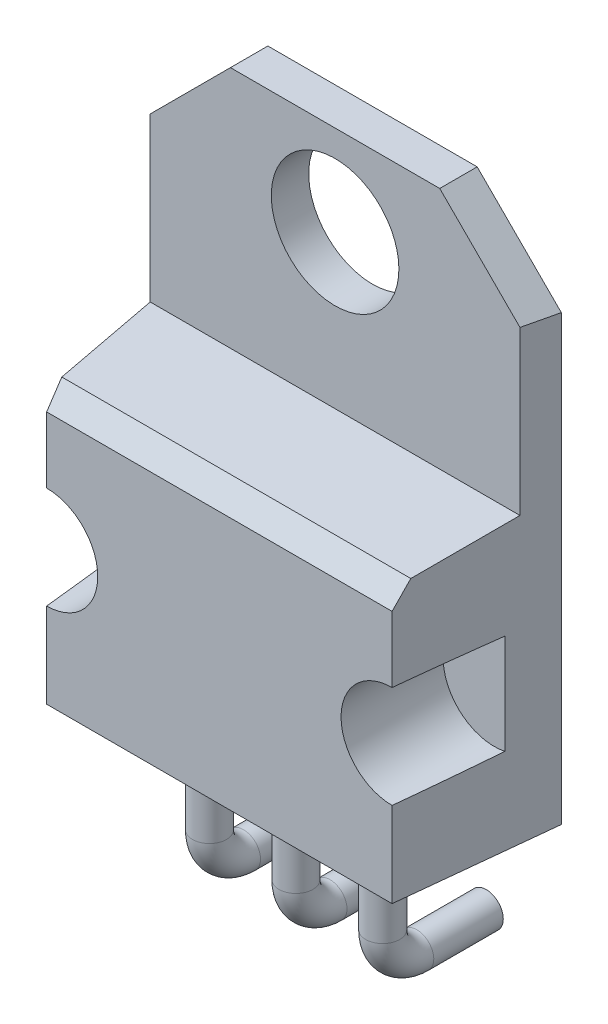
from build123d import *

# Parameters (mm, degrees)
ESQUISSE1_W             = 10.15
ESQUISSE1_H             = 15.5
EXTRUSION1_DEPTH        = 1.1
ESQUISSE2_R             = 1.875
ENL_V_MAT_EXTRU_1_DEPTH = 19.560239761
CHANFREIN1_SIZE         = 2
ESQUISSE3_W             = 10.15
ESQUISSE3_H             = 8
EXTRUSION2_DEPTH        = 3.4
ESQUISSE4_R             = 1.5
ENL_V_MAT_EXTRU_2_DEPTH = 3
D_POUILLE1_ANGLE        = 6
CHANFREIN2_SIZE         = 0.5
CHANFREIN2_SIZE2        = 0.561801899
ESQUISSE5_R             = 0.5
ESQUISSE9_R             = 0.5


with BuildPart() as part:
    # Esquisse1 → Extrusion1 (new body)
    with BuildSketch(Plane.XY):
        with Locations((5.075, 7.75)):
            Rectangle(ESQUISSE1_W, ESQUISSE1_H)
    extrude(amount=EXTRUSION1_DEPTH)

    # Esquisse2 → Enl_v. mat.-Extru.1 (cut, through all)
    with BuildSketch(Plane.XY.offset(1.1)):
        with Locations((5.075, 12.85)):
            Circle(ESQUISSE2_R)
    extrude(amount=-ENL_V_MAT_EXTRU_1_DEPTH, mode=Mode.SUBTRACT)

    # Chanfrein1
    chanfrein1_edges = [part.edges().sort_by_distance(p)[0] for p in [
        (0, 15.5, 0.55),
        (10.15, 15.5, 0.55),
    ]]
    chamfer(chanfrein1_edges, length=CHANFREIN1_SIZE)

    # Esquisse3 → Extrusion2 (add)
    with BuildSketch(Plane.XY.offset(1.1)):
        with Locations((5.075, 4)):
            Rectangle(ESQUISSE3_W, ESQUISSE3_H)
    extrude(amount=EXTRUSION2_DEPTH)

    # Esquisse4 → Enl_v. mat.-Extru.2 (cut)
    with BuildSketch(Plane.XY.offset(4.5)):
        with Locations((0, 4)):
            Circle(ESQUISSE4_R)
        with Locations((10.15, 4)):
            Circle(ESQUISSE4_R)
    extrude(amount=-ENL_V_MAT_EXTRU_2_DEPTH, mode=Mode.SUBTRACT)

    # D_pouille1
    d_pouille1_faces = [part.faces().sort_by_distance(p)[0] for p in [
        (10.15, 13.357697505, 0.55),
        (5.075, 8, 2.8),
        (0, 6.75, 0.142302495),
    ]]
    draft(d_pouille1_faces, Plane(origin=(0, 8, 4.5), x_dir=(1, 0, 0), z_dir=(0, 0, 1)), D_POUILLE1_ANGLE)

    # Chanfrein2
    chanfrein2_edges = [part.edges().sort_by_distance(p)[0] for p in [
        (5.075, 8, 4.5),
    ]]
    chanfrein2_side = [part.faces().sort_by_distance(p)[0] for p in [
        (5.075, 8.1807028, 2.780727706),
    ]]
    chamfer(chanfrein2_edges, length=CHANFREIN2_SIZE, length2=CHANFREIN2_SIZE2, reference=chanfrein2_side[0])

    # Balayage1: sweep along a path in Esquisse8
    with BuildLine(Plane(origin=(2.54, 0, 0), x_dir=(0, 0, -1), z_dir=(1, 0, 0))) as balayage1_path:
        Line((-2.25, 0), (-2.25, -3.05))
        ThreePointArc((-2.25, -3.05), (-1.957106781, -3.757106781), (-1.25, -4.05))
        Line((-1.25, -4.05), (0.791981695, -4.05))
    # Esquisse5 → Balayage1 (sweep)
    with BuildSketch(Plane.XZ):
        with Locations((2.535, 2.25)):
            Circle(ESQUISSE5_R)
    balayage1 = sweep(path=balayage1_path.line)

    # Balayage2: sweep along a path in Esquisse10
    with BuildLine(Plane(origin=(5.08, 0, 0), x_dir=(0, 0, -1), z_dir=(1, 0, 0))) as balayage2_path:
        Line((-2.25, 0), (-2.25, -3.05))
        ThreePointArc((-2.25, -3.05), (-1.957106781, -3.757106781), (-1.25, -4.05))
        Line((-1.25, -4.05), (0.791981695, -4.05))
    # Esquisse9 → Balayage2 (sweep)
    with BuildSketch(Plane.XZ):
        with Locations((5.075, 2.25)):
            Circle(ESQUISSE9_R)
    sweep(path=balayage2_path.line)

    # Sym_trie1: Balayage1 across plane
    add(balayage1.mirror(Plane(origin=(5.08, 0, 0), x_dir=(0, 0, 1), z_dir=(1, 0, 0))))


solid = part.part
